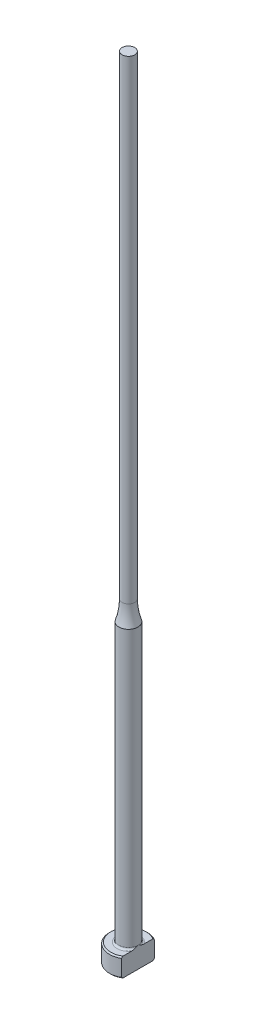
from build123d import *
from build123d.topology import SkipClean

# Parameters (mm, degrees)
CHAMFER1_SIZE = 0.2
FILLET1_R     = 0.3
KEY_DEPTH     = 126.071979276


with BuildPart() as part:
    # Sketch1 → Revolve1 (revolve)
    with BuildSketch(Plane.XY, mode=Mode.PRIVATE) as revolve1_sk:
        with BuildLine():
            Line((0, 0), (-3, 0))
            Line((-3, 0), (-3, 3))
            Line((-3, 3), (-1.5, 3))
            Line((-1.5, 3), (-1.5, 46.877501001))
            ThreePointArc((-1.5, 46.877501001), (-1.125791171, 48.41886117), (-1, 50))
            Line((-1, 50), (-1, 125))
            Line((-1, 125), (0, 125))
            Line((0, 125), (0, 0))
        make_face()
    revolve(revolve1_sk.sketch.rotate(Axis((0, 259.958771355, 0), (0, -1, 0)), 270), axis=Axis((0, 259.958771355, 0), (0, -1, 0)))

    # Chamfer1
    chamfer1_edges = [part.edges().sort_by_distance(p)[0] for p in [
        (0, 0, -3),
        (0, 3, -3),
    ]]
    chamfer(chamfer1_edges, length=CHAMFER1_SIZE)

    # Fillet1
    fillet1_edges = [part.edges().sort_by_distance(p)[0] for p in [
        (0, 3, -1.5),
    ]]
    fillet(fillet1_edges, radius=FILLET1_R)

    # Sketch2 → KEY (cut, through all)
    with SkipClean():  # the faces are left unmerged after this step: merging them gives an invalid solid
        with BuildSketch(Plane(origin=(0, 0, 0), x_dir=(1, 0, 0), z_dir=(0, 1, 0))):
            with BuildLine():
                Line((1.5, 2.598076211), (1.5, -2.598076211))
                ThreePointArc((1.5, -2.598076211), (3, 0), (1.5, 2.598076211))
            make_face()
        extrude(amount=KEY_DEPTH, mode=Mode.SUBTRACT)


solid = part.part
